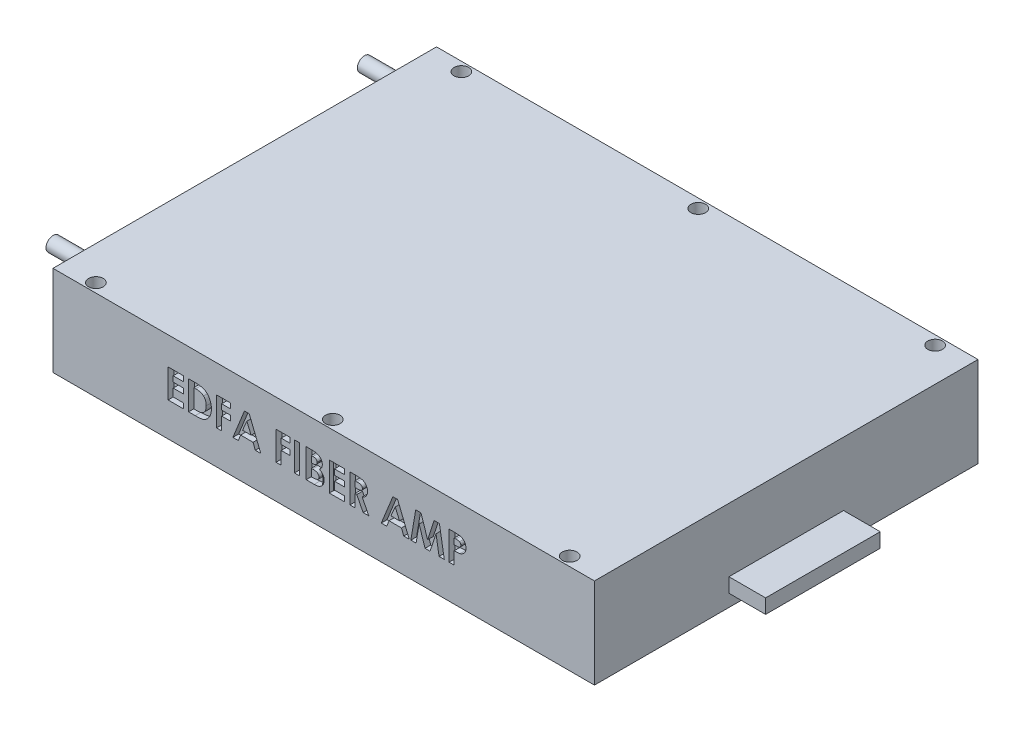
from build123d import *

# Parameters (mm, degrees)
SKETCH1_W                      = 240.0046
SKETCH1_H                      = 170.0022
BOSS_EXTRUDE1_DEPTH            = 40.005
SKETCH2_W                      = 50.8
SKETCH2_H                      = 6.35
BOSS_EXTRUDE2_DEPTH            = 50.8
SKETCH3_R                      = 3.175
BOSS_EXTRUDE3_DEPTH            = 50.8
CBORE_FOR_M3_SHCS1_D           = 3.4
CBORE_FOR_M3_SHCS1_CBORE_D     = 6.5
CBORE_FOR_M3_SHCS1_CBORE_DEPTH = 37.29
SKETCH5_W                      = 2.27948718
SKETCH5_H                      = 12.7
CUT_EXTRUDE1_DEPTH             = 2.54
SKETCH6_W                      = 2.279487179
SKETCH6_H                      = 12.7
CUT_EXTRUDE2_DEPTH             = 2.54
CUT_EXTRUDE3_DEPTH             = 340.217427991
CUT_EXTRUDE3_DEPTH_BACK        = 340.217427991
SKETCH9_W                      = 62.380762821
SKETCH9_H                      = 214.706433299
SKETCH9_W_2                    = 43.203871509
SKETCH9_H_2                    = 129.352926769


with BuildPart() as part:
    # Sketch1 → Boss-Extrude1 (new body)
    with BuildSketch(Plane(origin=(0, 0, 0), x_dir=(1, 0, 0), z_dir=(0, 1, 0))):
        with Locations((120.0023, 85.0011)):
            Rectangle(SKETCH1_W, SKETCH1_H)
    extrude(amount=BOSS_EXTRUDE1_DEPTH)

    # Sketch2 → Boss-Extrude2 (add)
    with BuildSketch(Plane(origin=(240.0046, 0, 0), x_dir=(0, 0, -1), z_dir=(1, 0, 0))):
        with Locations((85.0138, 8.636)):
            Rectangle(SKETCH2_W, SKETCH2_H)
    extrude(amount=BOSS_EXTRUDE2_DEPTH)

    # Sketch3 → Boss-Extrude3 (add)
    with BuildSketch(Plane.ZY):
        with Locations(Location((-154.0002, 33.5026, 0), (0, 0, 180))):
            Circle(SKETCH3_R)
        with Locations(Location((-16.002, 33.5026, 0), (0, 0, 180))):
            Circle(SKETCH3_R)
    extrude(amount=BOSS_EXTRUDE3_DEPTH)

    # CBORE for M3 SHCS1 (through all)
    with Locations(Plane(origin=(0, 40.005, 0), x_dir=(1, 0, 0), z_dir=(0, 1, 0))):
        with Locations((15.0114, 165.989), (120.015, 165.989), (225.0186, 165.989), (225.0186, 4.0132), (120.015, 4.0132), (15.0114, 4.0132)):
            CounterBoreHole(CBORE_FOR_M3_SHCS1_D / 2, CBORE_FOR_M3_SHCS1_CBORE_D / 2, CBORE_FOR_M3_SHCS1_CBORE_DEPTH)

    # Sketch5 → Cut-Extrude1 (cut)
    # profile 1 of 12: a face of its own
    with BuildSketch(Plane.XY):
        Polygon((51.003695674, 27.672615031), (57.842157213, 27.672615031), (57.842157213, 25.393127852), (53.283182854, 25.393127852), (53.283182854, 22.950820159), (57.842157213, 22.950820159), (57.842157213, 20.67133298), (53.283182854, 20.67133298), (53.283182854, 17.252102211), (57.842157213, 17.252102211), (57.842157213, 14.972615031), (51.003695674, 14.972615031), align=None)
    # profile 2 of 12: a face of its own
    with BuildSketch(Plane.XY):
        with BuildLine():
            Line((60.121644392, 27.672615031), (62.993900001, 27.672615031))
            add(Edge.make_bspline(
                [(62.993900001, 27.672615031), (63.217825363, 27.671049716), (63.650675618, 27.668023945), (64.277790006, 27.633930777), (64.860926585, 27.581497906), (65.400461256, 27.50936699), (65.895287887, 27.413918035), (66.344768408, 27.294196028), (66.750411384, 27.155996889), (67.116664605, 26.993377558), (67.451018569, 26.803779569), (67.768498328, 26.59258263), (68.06848052, 26.352049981), (68.355174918, 26.086821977), (68.624881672, 25.792046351), (68.882092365, 25.472605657), (69.120509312, 25.123867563), (69.347339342, 24.754193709), (69.552476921, 24.362017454), (69.731405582, 23.950676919), (69.881295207, 23.522819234), (70.003088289, 23.077988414), (70.100171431, 22.617661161), (70.16809855, 22.14090858), (70.210091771, 21.648172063), (70.214351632, 21.314220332), (70.216516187, 21.144530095)],
                knots=[0, 0, 0, 0, 1.44355588, 2.790409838, 4.047694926, 5.217575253, 6.298404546, 7.294384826, 8.214239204, 9.058592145, 9.873746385, 10.689560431, 11.514393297, 12.350027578, 13.205127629, 14.088021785, 14.991911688, 15.926770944, 16.882954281, 17.842803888, 18.816321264, 19.80318086, 20.814351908, 21.847355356, 22.906180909, 24, 24, 24, 24], degree=3))
            add(Edge.make_bspline(
                [(70.216516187, 21.144530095), (70.210848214, 20.905086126), (70.199690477, 20.433726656), (70.105703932, 19.742012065), (69.953695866, 19.078934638), (69.739958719, 18.449681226), (69.474981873, 17.859855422), (69.158437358, 17.319858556), (68.794966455, 16.832589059), (68.38880362, 16.400473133), (67.949028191, 16.029063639), (67.492012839, 15.710978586), (67.013305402, 15.46014198), (66.591497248, 15.301074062), (66.225736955, 15.202147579), (65.904603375, 15.143681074), (65.539828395, 15.090063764), (65.128010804, 15.04862946), (64.670957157, 15.011680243), (64.166845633, 14.991603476), (63.6173084, 14.974922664), (63.235602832, 14.973404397), (63.0371492, 14.972615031)],
                knots=[0, 0, 0, 0, 1.315458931, 2.589557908, 3.828601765, 5.048913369, 6.235739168, 7.376350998, 8.481830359, 9.569842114, 10.627874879, 11.640079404, 12.624025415, 13.590060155, 14.111227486, 14.704434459, 15.382649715, 16.137166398, 16.978595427, 17.902333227, 18.909396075, 20, 20, 20, 20], degree=3))
            Line((63.0371492, 14.972615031), (60.121644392, 14.972615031))
            Line((60.121644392, 14.972615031), (60.121644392, 27.672615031))
        make_face()
        with BuildLine():
            Line((62.401131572, 25.393127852), (62.401131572, 17.252102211))
            Line((62.401131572, 17.252102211), (63.591756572, 17.252102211))
            add(Edge.make_bspline(
                [(63.591756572, 17.252102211), (63.733422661, 17.252361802), (64.005893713, 17.252861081), (64.399280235, 17.276642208), (64.763063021, 17.300511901), (65.096240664, 17.345817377), (65.401237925, 17.396284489), (65.673864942, 17.466516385), (65.919741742, 17.540289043), (66.135864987, 17.63421078), (66.333816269, 17.739925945), (66.517096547, 17.863783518), (66.694013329, 18.001322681), (66.861259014, 18.156588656), (67.019466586, 18.327525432), (67.16769999, 18.515013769), (67.307937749, 18.718481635), (67.436580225, 18.939004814), (67.554134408, 19.174254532), (67.658418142, 19.421952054), (67.744884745, 19.684160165), (67.816750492, 19.958424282), (67.868106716, 20.247132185), (67.910594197, 20.548145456), (67.932497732, 20.862656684), (67.935503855, 21.076660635), (67.937029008, 21.185235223)],
                knots=[0, 0, 0, 0, 1.50275155, 2.890291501, 4.180787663, 5.369391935, 6.45668281, 7.458360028, 8.354766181, 9.177074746, 9.954075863, 10.732690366, 11.5210699, 12.329727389, 13.151100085, 13.990027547, 14.863562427, 15.770965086, 16.696477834, 17.652329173, 18.619756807, 19.62365428, 20.657822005, 21.729286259, 22.847956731, 24, 24, 24, 24], degree=3))
            add(Edge.make_bspline(
                [(67.937029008, 21.185235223), (67.933991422, 21.351615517), (67.928068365, 21.676044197), (67.870947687, 22.148581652), (67.77796612, 22.593546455), (67.645290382, 23.009287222), (67.478048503, 23.396972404), (67.268706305, 23.753317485), (67.026273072, 24.084308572), (66.834563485, 24.278478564), (66.738771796, 24.375499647)],
                knots=[0, 0, 0, 0, 1.13821349, 2.219428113, 3.251817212, 4.244760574, 5.201143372, 6.134805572, 7.068016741, 8, 8, 8, 8], degree=3))
            add(Edge.make_bspline(
                [(66.738771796, 24.375499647), (66.64431212, 24.458174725), (66.451388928, 24.62702921), (66.1126792, 24.829360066), (65.739438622, 25.007127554), (65.323128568, 25.148077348), (64.867772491, 25.259546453), (64.370658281, 25.33642397), (63.83444809, 25.385824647), (63.462974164, 25.390641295), (63.271203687, 25.393127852)],
                knots=[0, 0, 0, 0, 0.813307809, 1.661089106, 2.549956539, 3.493439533, 4.508053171, 5.589449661, 6.755572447, 8, 8, 8, 8], degree=3))
            Line((63.271203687, 25.393127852), (62.401131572, 25.393127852))
        make_face(mode=Mode.SUBTRACT)
    # profile 3 of 12: a face of its own
    with BuildSketch(Plane.XY):
        Polygon((72.496003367, 27.672615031), (78.683182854, 27.672615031), (78.683182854, 25.393127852), (74.775490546, 25.393127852), (74.775490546, 22.950820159), (78.683182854, 22.950820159), (78.683182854, 20.67133298), (74.775490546, 20.67133298), (74.775490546, 14.972615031), (72.496003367, 14.972615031), align=None)
    # profile 4 of 12: a face of its own
    with BuildSketch(Plane.XY):
        Polygon((84.872906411, 27.672615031), (86.987029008, 27.672615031), (92.115875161, 14.972615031), (89.681199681, 14.972615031), (88.694100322, 17.577743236), (83.160746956, 17.577743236), (82.173647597, 14.972615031), (79.741516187, 14.972615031), align=None)
        Polygon((85.928695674, 24.266104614), (84.025730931, 19.857230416), (87.831660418, 19.857230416), align=None, mode=Mode.SUBTRACT)
    # profile 5 of 12: a face of its own
    with BuildSketch(Plane.XY):
        Polygon((98.872926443, 27.672615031), (105.060105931, 27.672615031), (105.060105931, 25.393127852), (101.152413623, 25.393127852), (101.152413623, 22.950820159), (105.060105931, 22.950820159), (105.060105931, 20.67133298), (101.152413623, 20.67133298), (101.152413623, 14.972615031), (98.872926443, 14.972615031), align=None)
    # profile 6 of 12: a face of its own
    with BuildSketch(Plane.XY):
        with Locations((108.153695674, 21.322615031)):
            Rectangle(SKETCH5_W, SKETCH5_H)
    # profile 7 of 12: a face of its own
    with BuildSketch(Plane.XY):
        with BuildLine():
            Line((112.224208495, 14.972615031), (112.224208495, 27.672615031))
            Line((112.224208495, 27.672615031), (114.259464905, 27.672615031))
            add(Edge.make_bspline(
                [(114.259464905, 27.672615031), (114.40194558, 27.672631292), (114.677642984, 27.672662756), (115.075402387, 27.658694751), (115.444290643, 27.640625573), (115.783133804, 27.620410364), (116.092508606, 27.58557552), (116.371944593, 27.5488634), (116.622000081, 27.504590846), (116.776595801, 27.464876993), (116.849328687, 27.446192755)],
                knots=[0, 0, 0, 0, 1.311965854, 2.538629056, 3.664479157, 4.713267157, 5.663616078, 6.530575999, 7.308677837, 8, 8, 8, 8], degree=3))
            add(Edge.make_bspline(
                [(116.849328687, 27.446192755), (116.94483435, 27.419838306), (117.132247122, 27.368122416), (117.400682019, 27.26367994), (117.655329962, 27.147584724), (117.895880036, 27.015141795), (118.120855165, 26.864752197), (118.329400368, 26.695222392), (118.526013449, 26.513357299), (118.703713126, 26.314088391), (118.864324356, 26.103523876), (119.003866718, 25.88171893), (119.125111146, 25.652065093), (119.222138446, 25.411672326), (119.295246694, 25.161647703), (119.348717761, 24.903058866), (119.383374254, 24.635087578), (119.386648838, 24.452777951), (119.388311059, 24.360235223)],
                knots=[0, 0, 0, 0, 1.099996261, 2.158545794, 3.195537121, 4.207578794, 5.205712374, 6.197378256, 7.190519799, 8.17788031, 9.159561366, 10.129234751, 11.085776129, 12.040971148, 13.00380137, 13.975669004, 14.972423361, 16, 16, 16, 16], degree=3))
            add(Edge.make_bspline(
                [(119.388311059, 24.360235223), (119.383964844, 24.241342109), (119.375409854, 24.007315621), (119.320759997, 23.663573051), (119.218283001, 23.338686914), (119.084194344, 23.026669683), (118.901875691, 22.728685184), (118.670366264, 22.444875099), (118.393415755, 22.166500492), (118.180979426, 21.999633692), (118.070482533, 21.91283939)],
                knots=[0, 0, 0, 0, 0.986156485, 1.941127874, 2.875419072, 3.804401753, 4.751181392, 5.761612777, 6.835722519, 8, 8, 8, 8], degree=3))
            add(Edge.make_bspline(
                [(118.070482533, 21.91283939), (118.160023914, 21.867129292), (118.33558979, 21.777504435), (118.584841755, 21.630187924), (118.815621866, 21.473498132), (119.028964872, 21.31058772), (119.220395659, 21.134550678), (119.397818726, 20.955530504), (119.552480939, 20.763270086), (119.690784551, 20.56462195), (119.810995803, 20.35670965), (119.915686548, 20.139884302), (120.004115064, 19.913405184), (120.078998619, 19.67842489), (120.134846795, 19.434135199), (120.171260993, 19.180448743), (120.199141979, 18.918230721), (120.201310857, 18.739614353), (120.202413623, 18.648796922)],
                knots=[0, 0, 0, 0, 1.164658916, 2.283573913, 3.35186032, 4.395461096, 5.390182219, 6.362969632, 7.312859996, 8.245001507, 9.165155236, 10.092416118, 11.032087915, 11.979892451, 12.947605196, 13.931445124, 14.948243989, 16, 16, 16, 16], degree=3))
            add(Edge.make_bspline(
                [(120.202413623, 18.648796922), (120.195257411, 18.475340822), (120.181134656, 18.133025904), (120.07787596, 17.630428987), (119.898858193, 17.153921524), (119.658474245, 16.70539736), (119.362274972, 16.297840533), (119.021730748, 15.940824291), (118.640270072, 15.638617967), (118.288326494, 15.434652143), (117.983923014, 15.297772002), (117.731791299, 15.213144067), (117.461007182, 15.134744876), (117.166610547, 15.079691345), (116.853938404, 15.0293003), (116.519942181, 14.998187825), (116.16524611, 14.977103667), (115.921625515, 14.974141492), (115.796083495, 14.972615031)],
                knots=[0, 0, 0, 0, 1.284142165, 2.534249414, 3.780121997, 5.041676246, 6.291546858, 7.49970053, 8.684500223, 9.883330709, 10.50184324, 11.153274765, 11.851151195, 12.587658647, 13.369265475, 14.195992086, 15.070362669, 16, 16, 16, 16], degree=3))
            Line((115.796083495, 14.972615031), (112.224208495, 14.972615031))
        make_face()
        with BuildLine():
            Line((114.503695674, 25.393127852), (114.503695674, 22.625179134))
            Line((114.503695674, 22.625179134), (115.109184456, 22.625179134))
            add(Edge.make_bspline(
                [(115.109184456, 22.625179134), (115.191475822, 22.625896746), (115.350334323, 22.627282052), (115.579788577, 22.645124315), (115.793143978, 22.675564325), (115.989591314, 22.718035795), (116.170960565, 22.77196837), (116.33609309, 22.836860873), (116.484262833, 22.91603678), (116.656401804, 23.033972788), (116.83836511, 23.207520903), (116.998545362, 23.458247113), (117.09289046, 23.7465813), (117.10339796, 23.949936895), (117.108823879, 24.054946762)],
                knots=[0, 0, 0, 0, 1.065314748, 2.056525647, 2.977365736, 3.853934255, 4.656397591, 5.425096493, 6.14721249, 6.826394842, 8.123232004, 9.372140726, 10.643011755, 12, 12, 12, 12], degree=3))
            add(Edge.make_bspline(
                [(117.108823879, 24.054946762), (117.10448215, 24.153305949), (117.096087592, 24.343479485), (117.001094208, 24.610500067), (116.853550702, 24.847134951), (116.679354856, 25.009092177), (116.515315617, 25.119704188), (116.374855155, 25.192537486), (116.220689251, 25.257737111), (116.049833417, 25.307590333), (115.863263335, 25.344998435), (115.66188528, 25.372470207), (115.445351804, 25.391168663), (115.295791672, 25.392460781), (115.218579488, 25.393127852)],
                knots=[0, 0, 0, 0, 1.347982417, 2.606269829, 3.849316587, 5.153353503, 5.842674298, 6.568177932, 7.326619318, 8.142485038, 9.012069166, 9.942760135, 10.937925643, 12, 12, 12, 12], degree=3))
            Line((115.218579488, 25.393127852), (114.503695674, 25.393127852))
        make_face(mode=Mode.SUBTRACT)
        with BuildLine():
            Line((114.503695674, 20.508512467), (114.503695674, 17.252102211))
            Line((114.503695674, 17.252102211), (115.160065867, 17.252102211))
            add(Edge.make_bspline(
                [(115.160065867, 17.252102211), (115.289831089, 17.252843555), (115.539320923, 17.254268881), (115.896714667, 17.27149021), (116.221674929, 17.302528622), (116.513340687, 17.341277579), (116.772158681, 17.393776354), (116.997254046, 17.46052182), (117.191713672, 17.533953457), (117.35437157, 17.624650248), (117.487253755, 17.730198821), (117.607165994, 17.838071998), (117.704934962, 17.9625139), (117.782291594, 18.09818258), (117.849243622, 18.24170793), (117.889624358, 18.398694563), (117.920368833, 18.564489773), (117.922060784, 18.679166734), (117.922926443, 18.73783939)],
                knots=[0, 0, 0, 0, 1.753078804, 3.370512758, 4.83203934, 6.162291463, 7.344201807, 8.395507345, 9.331626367, 10.147333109, 10.898971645, 11.62040215, 12.321813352, 13.025280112, 13.727906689, 14.453419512, 15.208716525, 16, 16, 16, 16], degree=3))
            add(Edge.make_bspline(
                [(117.922926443, 18.73783939), (117.921017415, 18.804932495), (117.917299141, 18.935611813), (117.886931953, 19.126613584), (117.831744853, 19.30492641), (117.762234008, 19.475109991), (117.665505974, 19.631071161), (117.550548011, 19.778207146), (117.411649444, 19.911535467), (117.255449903, 20.039120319), (117.073258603, 20.150827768), (116.864990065, 20.247753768), (116.629512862, 20.328702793), (116.366097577, 20.39315446), (116.075899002, 20.447853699), (115.756799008, 20.480515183), (115.411455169, 20.504806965), (115.171988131, 20.507249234), (115.048126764, 20.508512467)],
                knots=[0, 0, 0, 0, 0.845221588, 1.646264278, 2.427170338, 3.19324141, 3.95557735, 4.731569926, 5.540061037, 6.376114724, 7.268642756, 8.224665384, 9.265483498, 10.400594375, 11.639216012, 12.983232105, 14.439614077, 16, 16, 16, 16], degree=3))
            Line((115.048126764, 20.508512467), (114.503695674, 20.508512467))
        make_face(mode=Mode.SUBTRACT)
    # profile 8 of 12: a face of its own
    with BuildSketch(Plane.XY):
        Polygon((122.481900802, 27.672615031), (129.320362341, 27.672615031), (129.320362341, 25.393127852), (124.761387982, 25.393127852), (124.761387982, 22.950820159), (129.320362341, 22.950820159), (129.320362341, 20.67133298), (124.761387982, 20.67133298), (124.761387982, 17.252102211), (129.320362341, 17.252102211), (129.320362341, 14.972615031), (122.481900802, 14.972615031), align=None)
    # profile 9 of 12: a face of its own
    with BuildSketch(Plane.XY):
        with BuildLine():
            Line((131.59984952, 27.672615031), (134.255859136, 27.672615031))
            add(Edge.make_bspline(
                [(134.255859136, 27.672615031), (134.431420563, 27.671991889), (134.76907464, 27.670793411), (135.255953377, 27.651884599), (135.703218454, 27.625571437), (136.111532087, 27.585416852), (136.480719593, 27.532176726), (136.811150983, 27.469415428), (137.102816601, 27.397885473), (137.358176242, 27.308753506), (137.58862569, 27.208213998), (137.803436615, 27.09269226), (138.007348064, 26.963474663), (138.19899711, 26.817161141), (138.380049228, 26.656383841), (138.550845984, 26.480980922), (138.708973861, 26.289465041), (138.853453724, 26.083046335), (138.98513549, 25.86589859), (139.101514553, 25.63772366), (139.1961542, 25.398362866), (139.279778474, 25.151275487), (139.340010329, 24.892929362), (139.381900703, 24.625839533), (139.412571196, 24.349065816), (139.414334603, 24.161038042), (139.415234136, 24.065123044)],
                knots=[0, 0, 0, 0, 1.749336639, 3.364467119, 4.854658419, 6.213483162, 7.451590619, 8.570285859, 9.5643256, 10.440900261, 11.26203566, 12.067320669, 12.869050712, 13.665104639, 14.467235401, 15.27997916, 16.102287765, 16.939272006, 17.78853747, 18.631303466, 19.488103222, 20.351255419, 21.228522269, 22.127379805, 23.044756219, 24, 24, 24, 24], degree=3))
            add(Edge.make_bspline(
                [(139.415234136, 24.065123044), (139.412897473, 23.96500982), (139.408315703, 23.768706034), (139.383635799, 23.480351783), (139.338528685, 23.204474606), (139.270207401, 22.941882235), (139.191680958, 22.689306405), (139.087260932, 22.451407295), (138.969412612, 22.22472501), (138.829447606, 22.012466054), (138.675842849, 21.809915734), (138.497203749, 21.624834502), (138.305103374, 21.447274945), (138.088743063, 21.288358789), (137.857660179, 21.137340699), (137.607263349, 21.000478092), (137.339186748, 20.874330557), (137.150715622, 20.803981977), (137.0543367, 20.768007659)],
                knots=[0, 0, 0, 0, 1.099860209, 2.156625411, 3.176576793, 4.16617041, 5.135385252, 6.078461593, 7.016046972, 7.938469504, 8.868247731, 9.803980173, 10.76021508, 11.73834243, 12.748633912, 13.790971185, 14.870363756, 16, 16, 16, 16], degree=3))
            Line((137.0543367, 20.768007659), (139.985105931, 14.972615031))
            Line((139.985105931, 14.972615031), (137.4512117, 14.972615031))
            Line((137.4512117, 14.972615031), (134.652734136, 20.508512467))
            Line((134.652734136, 20.508512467), (133.8793367, 20.508512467))
            Line((133.8793367, 20.508512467), (133.8793367, 14.972615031))
            Line((133.8793367, 14.972615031), (131.59984952, 14.972615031))
            Line((131.59984952, 14.972615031), (131.59984952, 27.672615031))
        make_face()
        with BuildLine():
            Line((133.8793367, 22.787999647), (134.767217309, 22.787999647))
            add(Edge.make_bspline(
                [(134.767217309, 22.787999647), (134.875768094, 22.789222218), (135.083619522, 22.791563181), (135.382537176, 22.802421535), (135.654025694, 22.828584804), (135.899250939, 22.861641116), (136.119446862, 22.899809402), (136.312649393, 22.954506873), (136.48183549, 23.013116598), (136.625000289, 23.085953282), (136.747317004, 23.16878439), (136.852929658, 23.262882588), (136.940286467, 23.37178927), (137.012185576, 23.492544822), (137.068115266, 23.626217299), (137.108939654, 23.771339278), (137.131754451, 23.929563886), (137.134379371, 24.03876041), (137.135746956, 24.09565189)],
                knots=[0, 0, 0, 0, 1.688639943, 3.233382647, 4.650958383, 5.928841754, 7.082724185, 8.122798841, 9.049171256, 9.863274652, 10.613301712, 11.341792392, 12.054588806, 12.776240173, 13.521029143, 14.301969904, 15.115324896, 16, 16, 16, 16], degree=3))
            add(Edge.make_bspline(
                [(137.135746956, 24.09565189), (137.133161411, 24.162958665), (137.128082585, 24.295170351), (137.077684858, 24.48550882), (136.997462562, 24.661680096), (136.887499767, 24.822888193), (136.749015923, 24.964214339), (136.590094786, 25.088794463), (136.407306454, 25.187303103), (136.238058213, 25.252278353), (136.084081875, 25.291153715), (135.945123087, 25.320123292), (135.784207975, 25.340654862), (135.601215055, 25.362432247), (135.396610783, 25.376553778), (135.169279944, 25.386859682), (134.919875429, 25.391076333), (134.746016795, 25.392424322), (134.655278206, 25.393127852)],
                knots=[0, 0, 0, 0, 1.020303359, 2.004196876, 2.966617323, 3.9489082, 4.950758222, 5.960522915, 7.003732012, 8.091992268, 8.70421221, 9.413913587, 10.24622431, 11.166358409, 12.212345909, 13.359657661, 14.621978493, 16, 16, 16, 16], degree=3))
            Line((134.655278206, 25.393127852), (133.8793367, 25.393127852))
            Line((133.8793367, 25.393127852), (133.8793367, 22.787999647))
        make_face(mode=Mode.SUBTRACT)
    # profile 10 of 12: a face of its own
    with BuildSketch(Plane.XY):
        Polygon((150.652393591, 27.672615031), (152.766516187, 27.672615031), (157.895362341, 14.972615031), (155.46068686, 14.972615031), (154.473587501, 17.577743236), (148.940234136, 17.577743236), (147.953134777, 14.972615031), (145.521003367, 14.972615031), align=None)
        Polygon((151.708182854, 24.266104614), (149.80521811, 19.857230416), (153.611147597, 19.857230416), align=None, mode=Mode.SUBTRACT)
    # profile 11 of 12: a face of its own
    with BuildSketch(Plane.XY):
        Polygon((160.772706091, 27.672615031), (163.138691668, 27.672615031), (166.036387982, 18.814161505), (168.95443686, 27.672615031), (171.297525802, 27.672615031), (173.444721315, 14.972615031), (171.13724936, 14.972615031), (169.781259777, 22.994069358), (167.140514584, 14.972615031), (164.916996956, 14.972615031), (162.291516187, 22.994069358), (160.938070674, 14.972615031), (158.628054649, 14.972615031), align=None)
    # profile 12 of 12: a face of its own
    with BuildSketch(Plane.XY):
        with BuildLine():
            Line((175.561387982, 27.672615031), (178.105458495, 27.672615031))
            add(Edge.make_bspline(
                [(178.105458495, 27.672615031), (178.271684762, 27.671870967), (178.592370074, 27.670435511), (179.054824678, 27.653028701), (179.481461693, 27.621834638), (179.8721831, 27.583283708), (180.226828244, 27.529236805), (180.545841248, 27.467276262), (180.829288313, 27.391790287), (181.080365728, 27.302189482), (181.305699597, 27.196553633), (181.518938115, 27.084043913), (181.715262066, 26.949767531), (181.904580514, 26.808196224), (182.076069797, 26.645805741), (182.240428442, 26.473403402), (182.390695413, 26.284151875), (182.527566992, 26.080341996), (182.651730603, 25.865739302), (182.760208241, 25.639960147), (182.848199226, 25.402647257), (182.922012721, 25.155335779), (182.981300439, 24.898036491), (183.020764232, 24.629166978), (183.047570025, 24.35060459), (183.049935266, 24.161014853), (183.051131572, 24.065123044)],
                knots=[0, 0, 0, 0, 1.698747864, 3.27724071, 4.728299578, 6.070144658, 7.288476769, 8.393259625, 9.389771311, 10.283485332, 11.113357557, 11.931608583, 12.74405601, 13.541433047, 14.344816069, 15.154114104, 15.974336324, 16.810834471, 17.661136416, 18.50621059, 19.367396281, 20.244825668, 21.142564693, 22.063065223, 23.020325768, 24, 24, 24, 24], degree=3))
            add(Edge.make_bspline(
                [(183.051131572, 24.065123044), (183.049400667, 23.959040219), (183.045999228, 23.750574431), (183.012654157, 23.444989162), (182.955690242, 23.153641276), (182.881241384, 22.874073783), (182.777427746, 22.610886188), (182.65882554, 22.357798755), (182.512907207, 22.121907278), (182.346172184, 21.900261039), (182.164078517, 21.69105795), (181.962303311, 21.500338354), (181.744692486, 21.326802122), (181.512505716, 21.168630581), (181.2648713, 21.026142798), (181.001967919, 20.898004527), (180.72200032, 20.788314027), (180.527039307, 20.730946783), (180.428194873, 20.701861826)],
                knots=[0, 0, 0, 0, 1.102006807, 2.165578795, 3.188629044, 4.184801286, 5.166646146, 6.124351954, 7.085497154, 8.042432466, 9.003981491, 9.963833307, 10.922997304, 11.89326795, 12.880200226, 13.889073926, 14.929769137, 16, 16, 16, 16], degree=3))
            add(Edge.make_bspline(
                [(180.428194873, 20.701861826), (180.363090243, 20.685663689), (180.222052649, 20.650573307), (179.988674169, 20.614947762), (179.719729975, 20.582192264), (179.414350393, 20.554042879), (179.072359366, 20.534907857), (178.69408803, 20.519964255), (178.279364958, 20.509098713), (177.990982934, 20.508713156), (177.840875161, 20.508512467)],
                knots=[0, 0, 0, 0, 0.618981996, 1.340914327, 2.176866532, 3.120127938, 4.170906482, 5.338178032, 6.614476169, 8, 8, 8, 8], degree=3))
            Line((177.840875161, 20.508512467), (177.840875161, 14.972615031))
            Line((177.840875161, 14.972615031), (175.561387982, 14.972615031))
            Line((175.561387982, 14.972615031), (175.561387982, 27.672615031))
        make_face()
        with BuildLine():
            Line((177.840875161, 22.787999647), (178.647345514, 22.787999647))
            add(Edge.make_bspline(
                [(178.647345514, 22.787999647), (178.794095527, 22.788930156), (179.064117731, 22.790642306), (179.432872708, 22.815400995), (179.729211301, 22.853212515), (179.963324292, 22.907442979), (180.148178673, 22.989744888), (180.307604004, 23.084952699), (180.44434718, 23.205340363), (180.562746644, 23.342903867), (180.657403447, 23.500971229), (180.723043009, 23.676968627), (180.765681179, 23.867198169), (180.76961921, 23.999585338), (180.771644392, 24.067667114)],
                knots=[0, 0, 0, 0, 1.8619151, 3.425951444, 4.686033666, 5.651700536, 6.461346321, 7.243864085, 7.999046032, 8.762387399, 9.539336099, 10.322741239, 11.137448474, 12, 12, 12, 12], degree=3))
            add(Edge.make_bspline(
                [(180.771644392, 24.067667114), (180.769640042, 24.127149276), (180.76575112, 24.24255897), (180.737182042, 24.409123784), (180.691651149, 24.564396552), (180.625678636, 24.706755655), (180.540391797, 24.835959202), (180.436409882, 24.951956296), (180.315067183, 25.057231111), (180.221383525, 25.112954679), (180.173787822, 25.141264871)],
                knots=[0, 0, 0, 0, 1.102301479, 2.1387299, 3.123554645, 4.094223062, 5.036071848, 5.982632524, 6.975082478, 8, 8, 8, 8], degree=3))
            add(Edge.make_bspline(
                [(180.173787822, 25.141264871), (180.133471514, 25.161653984), (180.048113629, 25.204821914), (179.902740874, 25.255007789), (179.734982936, 25.297345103), (179.543707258, 25.332484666), (179.329676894, 25.359756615), (179.092930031, 25.380612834), (178.833118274, 25.388999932), (178.652434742, 25.391713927), (178.558303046, 25.393127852)],
                knots=[0, 0, 0, 0, 0.656809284, 1.390599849, 2.23162475, 3.173112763, 4.218524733, 5.370385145, 6.63003504, 8, 8, 8, 8], degree=3))
            Line((178.558303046, 25.393127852), (177.840875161, 25.393127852))
            Line((177.840875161, 25.393127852), (177.840875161, 22.787999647))
        make_face(mode=Mode.SUBTRACT)
    extrude(amount=-CUT_EXTRUDE1_DEPTH, mode=Mode.SUBTRACT)

    # Sketch6 → Cut-Extrude2 (cut)
    # profile 1 of 12: a face of its own
    with BuildSketch(Plane(origin=(0, 0, -170.0022), x_dir=(-1, 0, 0), z_dir=(0, 0, -1))):
        Polygon((-173.294505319, 27.373876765), (-166.45604378, 27.373876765), (-166.45604378, 25.094389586), (-171.015018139, 25.094389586), (-171.015018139, 22.652081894), (-166.45604378, 22.652081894), (-166.45604378, 20.372594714), (-171.015018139, 20.372594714), (-171.015018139, 16.953363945), (-166.45604378, 16.953363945), (-166.45604378, 14.673876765), (-173.294505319, 14.673876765), align=None)
    # profile 2 of 12: a face of its own
    with BuildSketch(Plane(origin=(0, 0, -170.0022), x_dir=(-1, 0, 0), z_dir=(0, 0, -1))):
        with BuildLine():
            Line((-164.176556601, 27.373876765), (-161.304300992, 27.373876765))
            add(Edge.make_bspline(
                [(-161.304300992, 27.373876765), (-161.08037563, 27.37231145), (-160.647525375, 27.369285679), (-160.020410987, 27.335192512), (-159.437274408, 27.282759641), (-158.897739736, 27.210628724), (-158.402913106, 27.115179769), (-157.953432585, 26.995457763), (-157.547789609, 26.857258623), (-157.181536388, 26.694639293), (-156.847182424, 26.505041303), (-156.529702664, 26.293844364), (-156.229720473, 26.053311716), (-155.943026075, 25.788083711), (-155.673319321, 25.493308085), (-155.416108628, 25.173867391), (-155.177691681, 24.825129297), (-154.950861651, 24.455455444), (-154.745724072, 24.063279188), (-154.56679541, 23.651938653), (-154.416905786, 23.224080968), (-154.295112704, 22.779250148), (-154.198029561, 22.318922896), (-154.130102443, 21.842170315), (-154.088109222, 21.349433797), (-154.083849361, 21.015482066), (-154.081684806, 20.845791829)],
                knots=[0, 0, 0, 0, 1.44355588, 2.790409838, 4.047694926, 5.217575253, 6.298404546, 7.294384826, 8.214239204, 9.058592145, 9.873746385, 10.689560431, 11.514393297, 12.350027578, 13.205127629, 14.088021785, 14.991911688, 15.926770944, 16.882954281, 17.842803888, 18.816321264, 19.80318086, 20.814351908, 21.847355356, 22.906180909, 24, 24, 24, 24], degree=3))
            add(Edge.make_bspline(
                [(-154.081684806, 20.845791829), (-154.087352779, 20.60634786), (-154.098510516, 20.13498839), (-154.19249706, 19.443273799), (-154.344505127, 18.780196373), (-154.558242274, 18.15094296), (-154.82321912, 17.561117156), (-155.139763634, 17.02112029), (-155.503234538, 16.533850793), (-155.909397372, 16.101734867), (-156.349172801, 15.730325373), (-156.806188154, 15.41224032), (-157.284895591, 15.161403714), (-157.706703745, 15.002335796), (-158.072464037, 14.903409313), (-158.393597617, 14.844942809), (-158.758372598, 14.791325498), (-159.170190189, 14.749891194), (-159.627243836, 14.712941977), (-160.13135536, 14.692865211), (-160.680892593, 14.676184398), (-161.062598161, 14.674666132), (-161.261051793, 14.673876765)],
                knots=[0, 0, 0, 0, 1.315458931, 2.589557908, 3.828601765, 5.048913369, 6.235739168, 7.376350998, 8.481830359, 9.569842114, 10.627874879, 11.640079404, 12.624025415, 13.590060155, 14.111227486, 14.704434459, 15.382649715, 16.137166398, 16.978595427, 17.902333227, 18.909396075, 20, 20, 20, 20], degree=3))
            Line((-161.261051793, 14.673876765), (-164.176556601, 14.673876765))
            Line((-164.176556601, 14.673876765), (-164.176556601, 27.373876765))
        make_face()
        with BuildLine():
            Line((-161.897069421, 25.094389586), (-161.897069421, 16.953363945))
            Line((-161.897069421, 16.953363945), (-160.706444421, 16.953363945))
            add(Edge.make_bspline(
                [(-160.706444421, 16.953363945), (-160.564778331, 16.953623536), (-160.29230728, 16.954122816), (-159.898920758, 16.977903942), (-159.535137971, 17.001773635), (-159.201960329, 17.047079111), (-158.896963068, 17.097546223), (-158.624336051, 17.167778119), (-158.378459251, 17.241550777), (-158.162336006, 17.335472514), (-157.964384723, 17.44118768), (-157.781104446, 17.565045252), (-157.604187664, 17.702584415), (-157.436941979, 17.857850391), (-157.278734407, 18.028787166), (-157.130501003, 18.216275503), (-156.990263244, 18.419743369), (-156.861620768, 18.640266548), (-156.744066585, 18.875516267), (-156.639782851, 19.123213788), (-156.553316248, 19.385421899), (-156.481450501, 19.659686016), (-156.430094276, 19.948393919), (-156.387606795, 20.249407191), (-156.365703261, 20.563918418), (-156.362697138, 20.777922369), (-156.361171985, 20.886496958)],
                knots=[0, 0, 0, 0, 1.50275155, 2.890291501, 4.180787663, 5.369391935, 6.45668281, 7.458360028, 8.354766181, 9.177074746, 9.954075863, 10.732690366, 11.5210699, 12.329727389, 13.151100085, 13.990027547, 14.863562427, 15.770965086, 16.696477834, 17.652329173, 18.619756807, 19.62365428, 20.657822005, 21.729286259, 22.847956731, 24, 24, 24, 24], degree=3))
            add(Edge.make_bspline(
                [(-156.361171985, 20.886496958), (-156.364209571, 21.052877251), (-156.370132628, 21.377305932), (-156.427253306, 21.849843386), (-156.520234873, 22.294808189), (-156.652910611, 22.710548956), (-156.82015249, 23.098234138), (-157.029494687, 23.454579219), (-157.271927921, 23.785570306), (-157.463637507, 23.979740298), (-157.559429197, 24.076761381)],
                knots=[0, 0, 0, 0, 1.13821349, 2.219428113, 3.251817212, 4.244760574, 5.201143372, 6.134805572, 7.068016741, 8, 8, 8, 8], degree=3))
            add(Edge.make_bspline(
                [(-157.559429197, 24.076761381), (-157.653888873, 24.159436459), (-157.846812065, 24.328290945), (-158.185521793, 24.5306218), (-158.558762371, 24.708389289), (-158.975072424, 24.849339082), (-159.430428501, 24.960808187), (-159.927542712, 25.037685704), (-160.463752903, 25.087086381), (-160.835226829, 25.091903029), (-161.026997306, 25.094389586)],
                knots=[0, 0, 0, 0, 0.813307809, 1.661089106, 2.549956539, 3.493439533, 4.508053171, 5.589449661, 6.755572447, 8, 8, 8, 8], degree=3))
            Line((-161.026997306, 25.094389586), (-161.897069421, 25.094389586))
        make_face(mode=Mode.SUBTRACT)
    # profile 3 of 12: a face of its own
    with BuildSketch(Plane(origin=(0, 0, -170.0022), x_dir=(-1, 0, 0), z_dir=(0, 0, -1))):
        Polygon((-151.802197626, 27.373876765), (-145.615018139, 27.373876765), (-145.615018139, 25.094389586), (-149.522710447, 25.094389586), (-149.522710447, 22.652081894), (-145.615018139, 22.652081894), (-145.615018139, 20.372594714), (-149.522710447, 20.372594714), (-149.522710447, 14.673876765), (-151.802197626, 14.673876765), align=None)
    # profile 4 of 12: a face of its own
    with BuildSketch(Plane(origin=(0, 0, -170.0022), x_dir=(-1, 0, 0), z_dir=(0, 0, -1))):
        Polygon((-139.425294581, 27.373876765), (-137.311171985, 27.373876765), (-132.182325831, 14.673876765), (-134.617001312, 14.673876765), (-135.604100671, 17.279004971), (-141.137454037, 17.279004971), (-142.124553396, 14.673876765), (-144.556684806, 14.673876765), align=None)
        Polygon((-138.369505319, 23.967366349), (-140.272470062, 19.55849215), (-136.466540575, 19.55849215), align=None, mode=Mode.SUBTRACT)
    # profile 5 of 12: a face of its own
    with BuildSketch(Plane(origin=(0, 0, -170.0022), x_dir=(-1, 0, 0), z_dir=(0, 0, -1))):
        Polygon((-125.425274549, 27.373876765), (-119.238095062, 27.373876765), (-119.238095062, 25.094389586), (-123.14578737, 25.094389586), (-123.14578737, 22.652081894), (-119.238095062, 22.652081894), (-119.238095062, 20.372594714), (-123.14578737, 20.372594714), (-123.14578737, 14.673876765), (-125.425274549, 14.673876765), align=None)
    # profile 6 of 12: a face of its own
    with BuildSketch(Plane(origin=(0, 0, -170.0022), x_dir=(-1, 0, 0), z_dir=(0, 0, -1))):
        with Locations((-116.144505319, 21.023876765)):
            Rectangle(SKETCH6_W, SKETCH6_H)
    # profile 7 of 12: a face of its own
    with BuildSketch(Plane(origin=(0, 0, -170.0022), x_dir=(-1, 0, 0), z_dir=(0, 0, -1))):
        with BuildLine():
            Line((-112.073992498, 14.673876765), (-112.073992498, 27.373876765))
            Line((-112.073992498, 27.373876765), (-110.038736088, 27.373876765))
            add(Edge.make_bspline(
                [(-110.038736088, 27.373876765), (-109.896255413, 27.373893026), (-109.620558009, 27.37392449), (-109.222798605, 27.359956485), (-108.85391035, 27.341887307), (-108.515067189, 27.321672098), (-108.205692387, 27.286837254), (-107.9262564, 27.250125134), (-107.676200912, 27.20585258), (-107.521605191, 27.166138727), (-107.448872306, 27.14745449)],
                knots=[0, 0, 0, 0, 1.311965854, 2.538629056, 3.664479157, 4.713267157, 5.663616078, 6.530575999, 7.308677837, 8, 8, 8, 8], degree=3))
            add(Edge.make_bspline(
                [(-107.448872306, 27.14745449), (-107.353366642, 27.12110004), (-107.165953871, 27.06938415), (-106.897518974, 26.964941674), (-106.64287103, 26.848846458), (-106.402320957, 26.716403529), (-106.177345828, 26.566013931), (-105.968800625, 26.396484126), (-105.772187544, 26.214619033), (-105.594487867, 26.015350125), (-105.433876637, 25.80478561), (-105.294334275, 25.582980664), (-105.173089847, 25.353326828), (-105.076062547, 25.112934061), (-105.002954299, 24.862909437), (-104.949483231, 24.6043206), (-104.914826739, 24.336349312), (-104.911552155, 24.154039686), (-104.909889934, 24.061496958)],
                knots=[0, 0, 0, 0, 1.099996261, 2.158545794, 3.195537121, 4.207578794, 5.205712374, 6.197378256, 7.190519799, 8.17788031, 9.159561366, 10.129234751, 11.085776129, 12.040971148, 13.00380137, 13.975669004, 14.972423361, 16, 16, 16, 16], degree=3))
            add(Edge.make_bspline(
                [(-104.909889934, 24.061496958), (-104.914236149, 23.942603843), (-104.922791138, 23.708577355), (-104.977440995, 23.364834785), (-105.079917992, 23.039948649), (-105.214006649, 22.727931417), (-105.396325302, 22.429946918), (-105.627834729, 22.146136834), (-105.904785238, 21.867762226), (-106.117221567, 21.700895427), (-106.22771846, 21.614101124)],
                knots=[0, 0, 0, 0, 0.986156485, 1.941127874, 2.875419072, 3.804401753, 4.751181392, 5.761612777, 6.835722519, 8, 8, 8, 8], degree=3))
            add(Edge.make_bspline(
                [(-106.22771846, 21.614101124), (-106.138177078, 21.568391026), (-105.962611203, 21.478766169), (-105.713359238, 21.331449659), (-105.482579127, 21.174759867), (-105.269236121, 21.011849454), (-105.077805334, 20.835812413), (-104.900382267, 20.656792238), (-104.745720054, 20.46453182), (-104.607416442, 20.265883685), (-104.48720519, 20.057971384), (-104.382514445, 19.841146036), (-104.294085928, 19.614666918), (-104.219202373, 19.379686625), (-104.163354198, 19.135396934), (-104.12694, 18.881710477), (-104.099059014, 18.619492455), (-104.096890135, 18.440876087), (-104.09578737, 18.350058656)],
                knots=[0, 0, 0, 0, 1.164658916, 2.283573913, 3.35186032, 4.395461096, 5.390182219, 6.362969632, 7.312859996, 8.245001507, 9.165155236, 10.092416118, 11.032087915, 11.979892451, 12.947605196, 13.931445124, 14.948243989, 16, 16, 16, 16], degree=3))
            add(Edge.make_bspline(
                [(-104.09578737, 18.350058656), (-104.102943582, 18.176602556), (-104.117066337, 17.834287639), (-104.220325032, 17.331690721), (-104.3993428, 16.855183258), (-104.639726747, 16.406659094), (-104.935926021, 15.999102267), (-105.276470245, 15.642086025), (-105.65793092, 15.339879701), (-106.009874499, 15.135913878), (-106.314277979, 14.999033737), (-106.566409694, 14.914405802), (-106.837193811, 14.83600661), (-107.131590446, 14.78095308), (-107.444262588, 14.730562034), (-107.778258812, 14.699449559), (-108.132954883, 14.678365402), (-108.376575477, 14.675403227), (-108.502117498, 14.673876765)],
                knots=[0, 0, 0, 0, 1.284142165, 2.534249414, 3.780121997, 5.041676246, 6.291546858, 7.49970053, 8.684500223, 9.883330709, 10.50184324, 11.153274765, 11.851151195, 12.587658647, 13.369265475, 14.195992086, 15.070362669, 16, 16, 16, 16], degree=3))
            Line((-108.502117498, 14.673876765), (-112.073992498, 14.673876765))
        make_face()
        with BuildLine():
            Line((-109.794505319, 25.094389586), (-109.794505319, 22.326440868))
            Line((-109.794505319, 22.326440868), (-109.189016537, 22.326440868))
            add(Edge.make_bspline(
                [(-109.189016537, 22.326440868), (-109.106725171, 22.32715848), (-108.94786667, 22.328543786), (-108.718412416, 22.346386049), (-108.505057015, 22.376826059), (-108.308609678, 22.419297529), (-108.127240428, 22.473230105), (-107.962107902, 22.538122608), (-107.81393816, 22.617298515), (-107.641799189, 22.735234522), (-107.459835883, 22.908782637), (-107.299655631, 23.159508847), (-107.205310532, 23.447843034), (-107.194803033, 23.651198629), (-107.189377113, 23.756208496)],
                knots=[0, 0, 0, 0, 1.065314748, 2.056525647, 2.977365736, 3.853934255, 4.656397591, 5.425096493, 6.14721249, 6.826394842, 8.123232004, 9.372140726, 10.643011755, 12, 12, 12, 12], degree=3))
            add(Edge.make_bspline(
                [(-107.189377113, 23.756208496), (-107.193718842, 23.854567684), (-107.202113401, 24.04474122), (-107.297106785, 24.311761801), (-107.444650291, 24.548396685), (-107.618846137, 24.710353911), (-107.782885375, 24.820965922), (-107.923345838, 24.893799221), (-108.077511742, 24.958998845), (-108.248367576, 25.008852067), (-108.434937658, 25.04626017), (-108.636315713, 25.073731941), (-108.852849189, 25.092430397), (-109.002409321, 25.093722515), (-109.079621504, 25.094389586)],
                knots=[0, 0, 0, 0, 1.347982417, 2.606269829, 3.849316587, 5.153353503, 5.842674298, 6.568177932, 7.326619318, 8.142485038, 9.012069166, 9.942760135, 10.937925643, 12, 12, 12, 12], degree=3))
            Line((-109.079621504, 25.094389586), (-109.794505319, 25.094389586))
        make_face(mode=Mode.SUBTRACT)
        with BuildLine():
            Line((-109.794505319, 20.209774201), (-109.794505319, 16.953363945))
            Line((-109.794505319, 16.953363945), (-109.138135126, 16.953363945))
            add(Edge.make_bspline(
                [(-109.138135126, 16.953363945), (-109.008369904, 16.954105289), (-108.75888007, 16.955530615), (-108.401486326, 16.972751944), (-108.076526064, 17.003790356), (-107.784860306, 17.042539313), (-107.526042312, 17.095038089), (-107.300946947, 17.161783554), (-107.106487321, 17.235215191), (-106.943829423, 17.325911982), (-106.810947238, 17.431460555), (-106.691034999, 17.539333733), (-106.593266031, 17.663775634), (-106.515909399, 17.799444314), (-106.44895737, 17.942969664), (-106.408576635, 18.099956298), (-106.37783216, 18.265751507), (-106.376140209, 18.380428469), (-106.375274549, 18.439101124)],
                knots=[0, 0, 0, 0, 1.753078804, 3.370512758, 4.83203934, 6.162291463, 7.344201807, 8.395507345, 9.331626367, 10.147333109, 10.898971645, 11.62040215, 12.321813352, 13.025280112, 13.727906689, 14.453419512, 15.208716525, 16, 16, 16, 16], degree=3))
            add(Edge.make_bspline(
                [(-106.375274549, 18.439101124), (-106.377183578, 18.506194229), (-106.380901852, 18.636873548), (-106.41126904, 18.827875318), (-106.46645614, 19.006188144), (-106.535966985, 19.176371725), (-106.632695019, 19.332332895), (-106.747652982, 19.47946888), (-106.886551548, 19.612797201), (-107.04275109, 19.740382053), (-107.22494239, 19.852089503), (-107.433210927, 19.949015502), (-107.668688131, 20.029964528), (-107.932103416, 20.094416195), (-108.22230199, 20.149115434), (-108.541401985, 20.181776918), (-108.886745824, 20.206068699), (-109.126212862, 20.208510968), (-109.250074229, 20.209774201)],
                knots=[0, 0, 0, 0, 0.845221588, 1.646264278, 2.427170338, 3.19324141, 3.95557735, 4.731569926, 5.540061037, 6.376114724, 7.268642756, 8.224665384, 9.265483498, 10.400594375, 11.639216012, 12.983232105, 14.439614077, 16, 16, 16, 16], degree=3))
            Line((-109.250074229, 20.209774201), (-109.794505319, 20.209774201))
        make_face(mode=Mode.SUBTRACT)
    # profile 8 of 12: a face of its own
    with BuildSketch(Plane(origin=(0, 0, -170.0022), x_dir=(-1, 0, 0), z_dir=(0, 0, -1))):
        Polygon((-101.81630019, 27.373876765), (-94.977838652, 27.373876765), (-94.977838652, 25.094389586), (-99.536813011, 25.094389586), (-99.536813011, 22.652081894), (-94.977838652, 22.652081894), (-94.977838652, 20.372594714), (-99.536813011, 20.372594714), (-99.536813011, 16.953363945), (-94.977838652, 16.953363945), (-94.977838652, 14.673876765), (-101.81630019, 14.673876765), align=None)
    # profile 9 of 12: a face of its own
    with BuildSketch(Plane(origin=(0, 0, -170.0022), x_dir=(-1, 0, 0), z_dir=(0, 0, -1))):
        with BuildLine():
            Line((-92.698351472, 27.373876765), (-90.042341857, 27.373876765))
            add(Edge.make_bspline(
                [(-90.042341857, 27.373876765), (-89.86678043, 27.373253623), (-89.529126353, 27.372055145), (-89.042247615, 27.353146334), (-88.594982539, 27.326833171), (-88.186668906, 27.286678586), (-87.8174814, 27.23343846), (-87.487050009, 27.170677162), (-87.195384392, 27.099147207), (-86.940024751, 27.01001524), (-86.709575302, 26.909475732), (-86.494764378, 26.793953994), (-86.290852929, 26.664736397), (-86.099203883, 26.518422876), (-85.918151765, 26.357645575), (-85.747355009, 26.182242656), (-85.589227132, 25.990726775), (-85.444747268, 25.784308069), (-85.313065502, 25.567160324), (-85.19668644, 25.338985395), (-85.102046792, 25.0996246), (-85.018422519, 24.852537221), (-84.958190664, 24.594191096), (-84.91630029, 24.327101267), (-84.885629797, 24.050327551), (-84.88386639, 23.862299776), (-84.882966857, 23.766384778)],
                knots=[0, 0, 0, 0, 1.749336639, 3.364467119, 4.854658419, 6.213483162, 7.451590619, 8.570285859, 9.5643256, 10.440900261, 11.26203566, 12.067320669, 12.869050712, 13.665104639, 14.467235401, 15.27997916, 16.102287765, 16.939272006, 17.78853747, 18.631303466, 19.488103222, 20.351255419, 21.228522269, 22.127379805, 23.044756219, 24, 24, 24, 24], degree=3))
            add(Edge.make_bspline(
                [(-84.882966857, 23.766384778), (-84.88530352, 23.666271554), (-84.88988529, 23.469967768), (-84.914565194, 23.181613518), (-84.959672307, 22.90573634), (-85.027993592, 22.64314397), (-85.106520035, 22.390568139), (-85.210940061, 22.15266903), (-85.328788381, 21.925986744), (-85.468753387, 21.713727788), (-85.622358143, 21.511177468), (-85.800997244, 21.326096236), (-85.993097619, 21.148536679), (-86.20945793, 20.989620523), (-86.440540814, 20.838602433), (-86.690937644, 20.701739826), (-86.959014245, 20.575592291), (-87.147485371, 20.505243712), (-87.243864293, 20.469269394)],
                knots=[0, 0, 0, 0, 1.099860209, 2.156625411, 3.176576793, 4.16617041, 5.135385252, 6.078461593, 7.016046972, 7.938469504, 8.868247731, 9.803980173, 10.76021508, 11.73834243, 12.748633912, 13.790971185, 14.870363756, 16, 16, 16, 16], degree=3))
            Line((-87.243864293, 20.469269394), (-84.313095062, 14.673876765))
            Line((-84.313095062, 14.673876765), (-86.846989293, 14.673876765))
            Line((-86.846989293, 14.673876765), (-89.645466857, 20.209774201))
            Line((-89.645466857, 20.209774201), (-90.418864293, 20.209774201))
            Line((-90.418864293, 20.209774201), (-90.418864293, 14.673876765))
            Line((-90.418864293, 14.673876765), (-92.698351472, 14.673876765))
            Line((-92.698351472, 14.673876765), (-92.698351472, 27.373876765))
        make_face()
        with BuildLine():
            Line((-90.418864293, 22.489261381), (-89.530983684, 22.489261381))
            add(Edge.make_bspline(
                [(-89.530983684, 22.489261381), (-89.422432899, 22.490483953), (-89.21458147, 22.492824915), (-88.915663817, 22.50368327), (-88.644175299, 22.529846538), (-88.398950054, 22.56290285), (-88.178754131, 22.601071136), (-87.985551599, 22.655768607), (-87.816365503, 22.714378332), (-87.673200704, 22.787215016), (-87.550883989, 22.870046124), (-87.445271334, 22.964144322), (-87.357914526, 23.073051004), (-87.286015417, 23.193806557), (-87.230085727, 23.327479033), (-87.189261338, 23.472601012), (-87.166446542, 23.63082562), (-87.163821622, 23.740022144), (-87.162454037, 23.796913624)],
                knots=[0, 0, 0, 0, 1.688639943, 3.233382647, 4.650958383, 5.928841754, 7.082724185, 8.122798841, 9.049171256, 9.863274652, 10.613301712, 11.341792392, 12.054588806, 12.776240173, 13.521029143, 14.301969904, 15.115324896, 16, 16, 16, 16], degree=3))
            add(Edge.make_bspline(
                [(-87.162454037, 23.796913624), (-87.165039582, 23.864220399), (-87.170118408, 23.996432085), (-87.220516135, 24.186770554), (-87.300738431, 24.36294183), (-87.410701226, 24.524149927), (-87.54918507, 24.665476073), (-87.708106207, 24.790056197), (-87.890894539, 24.888564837), (-88.06014278, 24.953540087), (-88.214119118, 24.99241545), (-88.353077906, 25.021385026), (-88.513993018, 25.041916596), (-88.696985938, 25.063693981), (-88.90159021, 25.077815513), (-89.128921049, 25.088121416), (-89.378325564, 25.092338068), (-89.552184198, 25.093686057), (-89.642922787, 25.094389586)],
                knots=[0, 0, 0, 0, 1.020303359, 2.004196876, 2.966617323, 3.9489082, 4.950758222, 5.960522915, 7.003732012, 8.091992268, 8.70421221, 9.413913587, 10.24622431, 11.166358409, 12.212345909, 13.359657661, 14.621978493, 16, 16, 16, 16], degree=3))
            Line((-89.642922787, 25.094389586), (-90.418864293, 25.094389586))
            Line((-90.418864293, 25.094389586), (-90.418864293, 22.489261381))
        make_face(mode=Mode.SUBTRACT)
    # profile 10 of 12: a face of its own
    with BuildSketch(Plane(origin=(0, 0, -170.0022), x_dir=(-1, 0, 0), z_dir=(0, 0, -1))):
        Polygon((-73.645807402, 27.373876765), (-71.531684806, 27.373876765), (-66.402838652, 14.673876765), (-68.837514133, 14.673876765), (-69.824613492, 17.279004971), (-75.357966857, 17.279004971), (-76.345066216, 14.673876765), (-78.777197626, 14.673876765), align=None)
        Polygon((-72.590018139, 23.967366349), (-74.492982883, 19.55849215), (-70.687053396, 19.55849215), align=None, mode=Mode.SUBTRACT)
    # profile 11 of 12: a face of its own
    with BuildSketch(Plane(origin=(0, 0, -170.0022), x_dir=(-1, 0, 0), z_dir=(0, 0, -1))):
        Polygon((-63.525494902, 27.373876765), (-61.159509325, 27.373876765), (-58.261813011, 18.51542324), (-55.343764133, 27.373876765), (-53.00067519, 27.373876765), (-50.853479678, 14.673876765), (-53.160951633, 14.673876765), (-54.516941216, 22.695331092), (-57.157686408, 14.673876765), (-59.381204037, 14.673876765), (-62.006684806, 22.695331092), (-63.360130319, 14.673876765), (-65.670146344, 14.673876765), align=None)
    # profile 12 of 12: a face of its own
    with BuildSketch(Plane(origin=(0, 0, -170.0022), x_dir=(-1, 0, 0), z_dir=(0, 0, -1))):
        with BuildLine():
            Line((-48.736813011, 27.373876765), (-46.192742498, 27.373876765))
            add(Edge.make_bspline(
                [(-46.192742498, 27.373876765), (-46.026516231, 27.373132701), (-45.705830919, 27.371697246), (-45.243376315, 27.354290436), (-44.8167393, 27.323096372), (-44.426017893, 27.284545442), (-44.071372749, 27.230498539), (-43.752359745, 27.168537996), (-43.46891268, 27.093052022), (-43.217835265, 27.003451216), (-42.992501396, 26.897815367), (-42.779262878, 26.785305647), (-42.582938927, 26.651029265), (-42.393620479, 26.509457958), (-42.222131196, 26.347067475), (-42.057772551, 26.174665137), (-41.90750558, 25.985413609), (-41.770634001, 25.781603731), (-41.646470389, 25.567001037), (-41.537992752, 25.341221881), (-41.450001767, 25.103908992), (-41.376188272, 24.856597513), (-41.316900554, 24.599298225), (-41.277436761, 24.330428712), (-41.250630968, 24.051866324), (-41.248265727, 23.862276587), (-41.247069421, 23.766384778)],
                knots=[0, 0, 0, 0, 1.698747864, 3.27724071, 4.728299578, 6.070144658, 7.288476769, 8.393259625, 9.389771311, 10.283485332, 11.113357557, 11.931608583, 12.74405601, 13.541433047, 14.344816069, 15.154114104, 15.974336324, 16.810834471, 17.661136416, 18.50621059, 19.367396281, 20.244825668, 21.142564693, 22.063065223, 23.020325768, 24, 24, 24, 24], degree=3))
            add(Edge.make_bspline(
                [(-41.247069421, 23.766384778), (-41.248800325, 23.660301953), (-41.252201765, 23.451836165), (-41.285546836, 23.146250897), (-41.342510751, 22.85490301), (-41.416959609, 22.575335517), (-41.520773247, 22.312147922), (-41.639375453, 22.059060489), (-41.785293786, 21.823169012), (-41.952028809, 21.601522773), (-42.134122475, 21.392319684), (-42.335897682, 21.201600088), (-42.553508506, 21.028063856), (-42.785695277, 20.869892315), (-43.033329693, 20.727404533), (-43.296233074, 20.599266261), (-43.576200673, 20.489575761), (-43.771161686, 20.432208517), (-43.87000612, 20.40312356)],
                knots=[0, 0, 0, 0, 1.102006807, 2.165578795, 3.188629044, 4.184801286, 5.166646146, 6.124351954, 7.085497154, 8.042432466, 9.003981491, 9.963833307, 10.922997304, 11.89326795, 12.880200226, 13.889073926, 14.929769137, 16, 16, 16, 16], degree=3))
            add(Edge.make_bspline(
                [(-43.87000612, 20.40312356), (-43.93511075, 20.386925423), (-44.076148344, 20.351835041), (-44.309526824, 20.316209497), (-44.578471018, 20.283453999), (-44.8838506, 20.255304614), (-45.225841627, 20.236169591), (-45.604112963, 20.221225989), (-46.018836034, 20.210360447), (-46.307218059, 20.20997489), (-46.457325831, 20.209774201)],
                knots=[0, 0, 0, 0, 0.618981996, 1.340914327, 2.176866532, 3.120127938, 4.170906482, 5.338178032, 6.614476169, 8, 8, 8, 8], degree=3))
            Line((-46.457325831, 20.209774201), (-46.457325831, 14.673876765))
            Line((-46.457325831, 14.673876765), (-48.736813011, 14.673876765))
            Line((-48.736813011, 14.673876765), (-48.736813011, 27.373876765))
        make_face()
        with BuildLine():
            Line((-46.457325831, 22.489261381), (-45.650855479, 22.489261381))
            add(Edge.make_bspline(
                [(-45.650855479, 22.489261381), (-45.504105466, 22.49019189), (-45.234083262, 22.49190404), (-44.865328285, 22.516662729), (-44.568989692, 22.554474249), (-44.334876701, 22.608704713), (-44.15002232, 22.691006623), (-43.990596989, 22.786214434), (-43.853853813, 22.906602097), (-43.735454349, 23.044165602), (-43.640797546, 23.202232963), (-43.575157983, 23.378230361), (-43.532519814, 23.568459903), (-43.528581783, 23.700847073), (-43.526556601, 23.768928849)],
                knots=[0, 0, 0, 0, 1.8619151, 3.425951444, 4.686033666, 5.651700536, 6.461346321, 7.243864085, 7.999046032, 8.762387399, 9.539336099, 10.322741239, 11.137448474, 12, 12, 12, 12], degree=3))
            add(Edge.make_bspline(
                [(-43.526556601, 23.768928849), (-43.528560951, 23.82841101), (-43.532449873, 23.943820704), (-43.561018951, 24.110385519), (-43.606549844, 24.265658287), (-43.672522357, 24.40801739), (-43.757809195, 24.537220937), (-43.86179111, 24.65321803), (-43.98313381, 24.758492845), (-44.076817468, 24.814216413), (-44.124413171, 24.842526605)],
                knots=[0, 0, 0, 0, 1.102301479, 2.1387299, 3.123554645, 4.094223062, 5.036071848, 5.982632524, 6.975082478, 8, 8, 8, 8], degree=3))
            add(Edge.make_bspline(
                [(-44.124413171, 24.842526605), (-44.164729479, 24.862915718), (-44.250087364, 24.906083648), (-44.395460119, 24.956269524), (-44.563218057, 24.998606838), (-44.754493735, 25.0337464), (-44.968524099, 25.061018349), (-45.205270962, 25.081874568), (-45.465082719, 25.090261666), (-45.64576625, 25.092975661), (-45.739897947, 25.094389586)],
                knots=[0, 0, 0, 0, 0.656809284, 1.390599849, 2.23162475, 3.173112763, 4.218524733, 5.370385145, 6.63003504, 8, 8, 8, 8], degree=3))
            Line((-45.739897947, 25.094389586), (-46.457325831, 25.094389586))
            Line((-46.457325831, 25.094389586), (-46.457325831, 22.489261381))
        make_face(mode=Mode.SUBTRACT)
    extrude(amount=-CUT_EXTRUDE2_DEPTH, mode=Mode.SUBTRACT)

    # Sketch9 → Cut-Extrude3 (cut, two sides: drawn at the far end of the back side and taken through both)
    with BuildSketch(Plane(origin=(0, 40.005, 0), x_dir=(1, 0, 0), z_dir=(0, 1, 0)).offset(-CUT_EXTRUDE3_DEPTH_BACK)):
        with Locations((-47.113198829, 88.146647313)):
            Rectangle(SKETCH9_W, SKETCH9_H)
        with Locations((277.852537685, 83.834273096)):
            Rectangle(SKETCH9_W_2, SKETCH9_H_2)
    extrude(amount=CUT_EXTRUDE3_DEPTH + CUT_EXTRUDE3_DEPTH_BACK, mode=Mode.SUBTRACT)


solid = part.part
